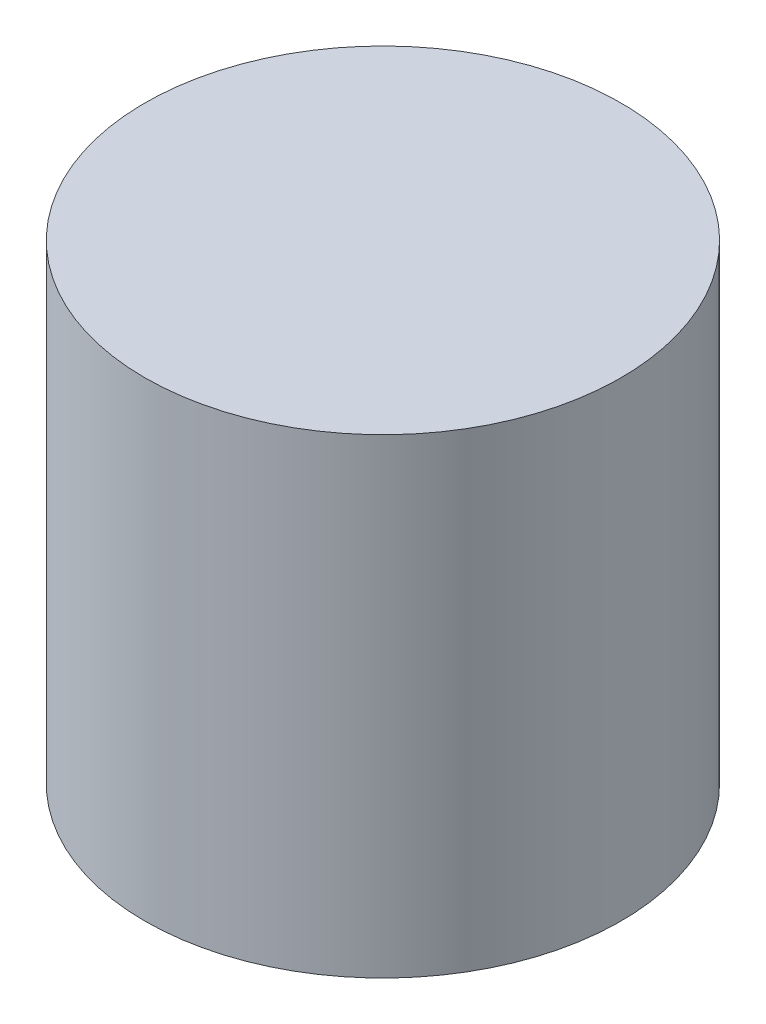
from build123d import *

# Parameters (mm, degrees)
SKETCH1_R           = 10.922
BOSS_EXTRUDE1_DEPTH = 21.59


with BuildPart() as part:
    # Sketch1 → Boss-Extrude1 (new body)
    with BuildSketch(Plane(origin=(0, 0, 0), x_dir=(1, 0, 0), z_dir=(0, 1, 0))):
        with Locations(Location((0, 0, 0), (0, 0, 270))):
            Circle(SKETCH1_R)
    extrude(amount=BOSS_EXTRUDE1_DEPTH)


solid = part.part
